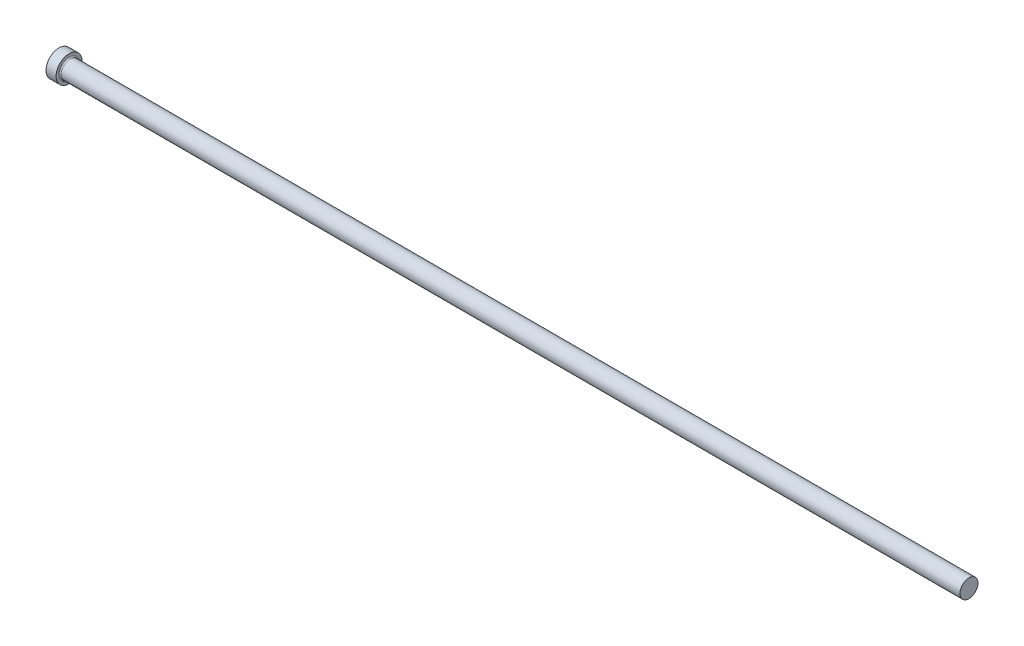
ISO-10303-21;
HEADER;
FILE_DESCRIPTION(('STEP AP214'),'2;1');
FILE_NAME('part.step','',(''),(''),'','','');
FILE_SCHEMA(('AUTOMOTIVE_DESIGN { 1 0 10303 214 1 1 1 1 }'));
ENDSEC;
DATA;
#1=APPLICATION_CONTEXT('core data for automotive mechanical design processes');
#2=APPLICATION_PROTOCOL_DEFINITION('international standard','automotive_design',2000,#1);
#3=PRODUCT_CONTEXT('',#1,'mechanical');
#4=PRODUCT('Part','Part','',(#3));
#5=PRODUCT_RELATED_PRODUCT_CATEGORY('part','',(#4));
#6=PRODUCT_DEFINITION_FORMATION('','',#4);
#7=PRODUCT_DEFINITION_CONTEXT('part definition',#1,'design');
#8=PRODUCT_DEFINITION('design','',#6,#7);
#9=PRODUCT_DEFINITION_SHAPE('','',#8);
#10=(LENGTH_UNIT() NAMED_UNIT(*) SI_UNIT(.MILLI.,.METRE.));
#11=(NAMED_UNIT(*) PLANE_ANGLE_UNIT() SI_UNIT($,.RADIAN.));
#12=(NAMED_UNIT(*) SI_UNIT($,.STERADIAN.) SOLID_ANGLE_UNIT());
#13=UNCERTAINTY_MEASURE_WITH_UNIT(LENGTH_MEASURE(1.E-05),#10,'distance_accuracy_value','');
#14=(GEOMETRIC_REPRESENTATION_CONTEXT(3) GLOBAL_UNCERTAINTY_ASSIGNED_CONTEXT((#13)) GLOBAL_UNIT_ASSIGNED_CONTEXT((#10,
#11,#12)) REPRESENTATION_CONTEXT('',''));
#15=CARTESIAN_POINT('',(0.,0.,0.));
#16=DIRECTION('',(0.,0.,1.));
#17=DIRECTION('',(1.,0.,0.));
#18=AXIS2_PLACEMENT_3D('',#15,#16,#17);
#19=CARTESIAN_POINT('',(0.,0.,0.));
#20=DIRECTION('',(-1.,0.,0.));
#21=DIRECTION('',(0.,-1.,0.));
#22=AXIS2_PLACEMENT_3D('',#19,#20,#21);
#23=PLANE('',#22);
#24=CARTESIAN_POINT('',(0.,0.,0.));
#25=DIRECTION('',(1.,0.,0.));
#26=DIRECTION('',(0.,1.,0.));
#27=AXIS2_PLACEMENT_3D('',#24,#25,#26);
#28=CIRCLE('',#27,9.);
#29=CARTESIAN_POINT('',(0.,9.,0.));
#30=VERTEX_POINT('',#29);
#31=EDGE_CURVE('E25',#30,#30,#28,.T.);
#32=ORIENTED_EDGE('',*,*,#31,.F.);
#33=EDGE_LOOP('',(#32));
#34=FACE_BOUND('',#33,.T.);
#35=ADVANCED_FACE('F14',(#34),#23,.T.);
#36=CARTESIAN_POINT('',(630.,0.,0.));
#37=DIRECTION('',(1.,0.,0.));
#38=DIRECTION('',(0.,1.,0.));
#39=AXIS2_PLACEMENT_3D('',#36,#37,#38);
#40=CYLINDRICAL_SURFACE('',#39,9.);
#41=ORIENTED_EDGE('',*,*,#31,.T.);
#42=EDGE_LOOP('',(#41));
#43=FACE_BOUND('',#42,.T.);
#44=CARTESIAN_POINT('',(7.,0.,0.));
#45=DIRECTION('',(1.,0.,0.));
#46=DIRECTION('',(0.,1.,0.));
#47=AXIS2_PLACEMENT_3D('',#44,#45,#46);
#48=CIRCLE('',#47,9.);
#49=CARTESIAN_POINT('',(7.,9.,0.));
#50=VERTEX_POINT('',#49);
#51=EDGE_CURVE('E29',#50,#50,#48,.T.);
#52=ORIENTED_EDGE('',*,*,#51,.F.);
#53=EDGE_LOOP('',(#52));
#54=FACE_BOUND('',#53,.T.);
#55=ADVANCED_FACE('F51',(#43,#54),#40,.T.);
#56=CARTESIAN_POINT('',(7.,9.,0.));
#57=DIRECTION('',(1.,0.,0.));
#58=DIRECTION('',(0.,1.,0.));
#59=AXIS2_PLACEMENT_3D('',#56,#57,#58);
#60=PLANE('',#59);
#61=CARTESIAN_POINT('',(7.,0.,0.));
#62=DIRECTION('',(1.,0.,0.));
#63=DIRECTION('',(0.,1.,0.));
#64=AXIS2_PLACEMENT_3D('',#61,#62,#63);
#65=CIRCLE('',#64,7.04999999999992);
#66=CARTESIAN_POINT('',(7.,7.04999999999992,0.));
#67=VERTEX_POINT('',#66);
#68=EDGE_CURVE('E9',#67,#67,#65,.F.);
#69=ORIENTED_EDGE('',*,*,#68,.T.);
#70=EDGE_LOOP('',(#69));
#71=FACE_BOUND('',#70,.T.);
#72=ORIENTED_EDGE('',*,*,#51,.T.);
#73=EDGE_LOOP('',(#72));
#74=FACE_BOUND('',#73,.T.);
#75=ADVANCED_FACE('F42',(#71,#74),#60,.T.);
#76=CARTESIAN_POINT('',(630.,0.,0.));
#77=DIRECTION('',(1.,0.,0.));
#78=DIRECTION('',(0.,1.,0.));
#79=AXIS2_PLACEMENT_3D('',#76,#77,#78);
#80=CYLINDRICAL_SURFACE('',#79,6.24999999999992);
#81=CARTESIAN_POINT('',(7.8,0.,0.));
#82=DIRECTION('',(1.,0.,0.));
#83=DIRECTION('',(0.,1.,0.));
#84=AXIS2_PLACEMENT_3D('',#81,#82,#83);
#85=CIRCLE('',#84,6.24999999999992);
#86=CARTESIAN_POINT('',(7.8,6.24999999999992,0.));
#87=VERTEX_POINT('',#86);
#88=EDGE_CURVE('E21',#87,#87,#85,.T.);
#89=ORIENTED_EDGE('',*,*,#88,.T.);
#90=EDGE_LOOP('',(#89));
#91=FACE_BOUND('',#90,.T.);
#92=CARTESIAN_POINT('',(630.,0.,0.));
#93=DIRECTION('',(1.,0.,0.));
#94=DIRECTION('',(0.,1.,0.));
#95=AXIS2_PLACEMENT_3D('',#92,#93,#94);
#96=CIRCLE('',#95,6.24999999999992);
#97=CARTESIAN_POINT('',(630.,6.24999999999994,0.));
#98=VERTEX_POINT('',#97);
#99=EDGE_CURVE('E34',#98,#98,#96,.T.);
#100=ORIENTED_EDGE('',*,*,#99,.F.);
#101=EDGE_LOOP('',(#100));
#102=FACE_BOUND('',#101,.T.);
#103=ADVANCED_FACE('F40',(#91,#102),#80,.T.);
#104=CARTESIAN_POINT('',(630.,6.25,0.));
#105=DIRECTION('',(1.,0.,0.));
#106=DIRECTION('',(0.,1.,0.));
#107=AXIS2_PLACEMENT_3D('',#104,#105,#106);
#108=PLANE('',#107);
#109=ORIENTED_EDGE('',*,*,#99,.T.);
#110=EDGE_LOOP('',(#109));
#111=FACE_BOUND('',#110,.T.);
#112=ADVANCED_FACE('F38',(#111),#108,.T.);
#113=CARTESIAN_POINT('',(7.8,0.,0.));
#114=DIRECTION('',(1.,0.,0.));
#115=DIRECTION('',(0.,1.,0.));
#116=AXIS2_PLACEMENT_3D('',#113,#114,#115);
#117=TOROIDAL_SURFACE('',#116,7.04999999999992,0.8);
#118=ORIENTED_EDGE('',*,*,#68,.F.);
#119=EDGE_LOOP('',(#118));
#120=FACE_BOUND('',#119,.T.);
#121=ORIENTED_EDGE('',*,*,#88,.F.);
#122=EDGE_LOOP('',(#121));
#123=FACE_BOUND('',#122,.T.);
#124=ADVANCED_FACE('F16',(#120,#123),#117,.F.);
#125=CLOSED_SHELL('',(#35,#55,#75,#103,#112,#124));
#126=MANIFOLD_SOLID_BREP('B1',#125);
#127=ADVANCED_BREP_SHAPE_REPRESENTATION('',(#18,#126),#14);
#128=SHAPE_DEFINITION_REPRESENTATION(#9,#127);
ENDSEC;
END-ISO-10303-21;
